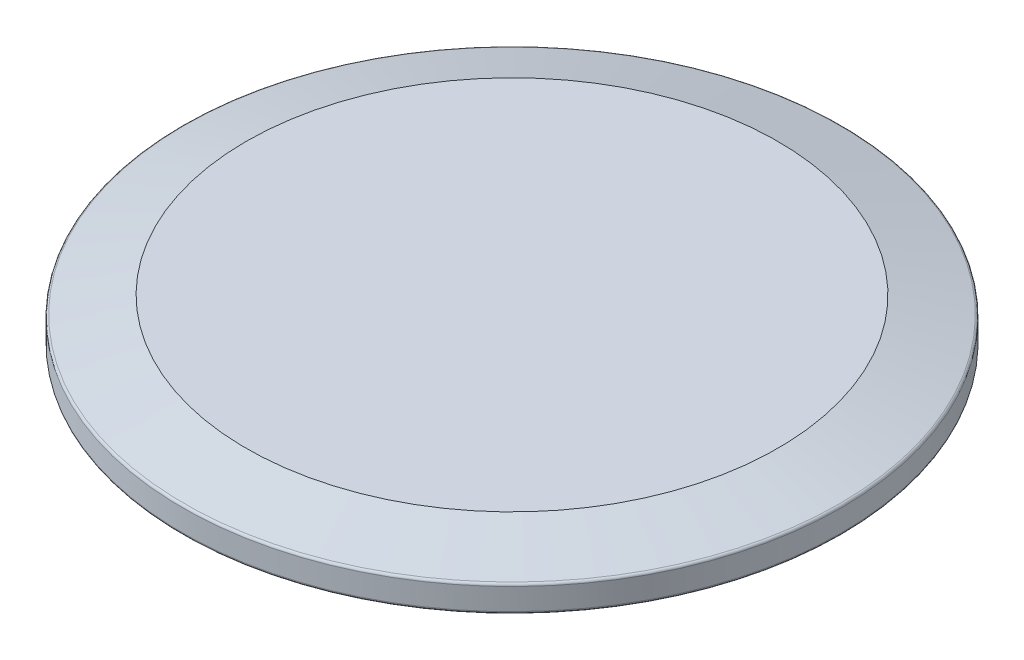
from build123d import *

# Parameters (mm, degrees)
FILLET_1_R = 0.3
FILLET_2_R = 0.3
FILLET_3_R = 0.3


with BuildPart() as part:
    # Sketch 1 → Revolve 1 (revolve)
    with BuildSketch(Plane.XY):
        Polygon((-26.3, 2.5), (-23.1, 2.5), (-23.1, 0), (0, 0), (0, 5), (-30.25, 5), (-37.5, 3), (-37.5, 0), (-26.3, 0), align=None)
    revolve(axis=Axis((0, 5, 0), (0, -1, 0)))

    # Fillet 1
    fillet_1_edges = [part.edges().sort_by_distance(p)[0] for p in [
        (37.5, 3, 0),
    ]]
    fillet(fillet_1_edges, radius=FILLET_1_R)

    # Fillet 2
    fillet_2_edges = [part.edges().sort_by_distance(p)[0] for p in [
        (37.5, 0, 0),
    ]]
    fillet(fillet_2_edges, radius=FILLET_2_R)

    # Fillet 3
    fillet_3_edges = [part.edges().sort_by_distance(p)[0] for p in [
        (26.3, 0, 0),
    ]]
    fillet(fillet_3_edges, radius=FILLET_3_R)


solid = part.part
